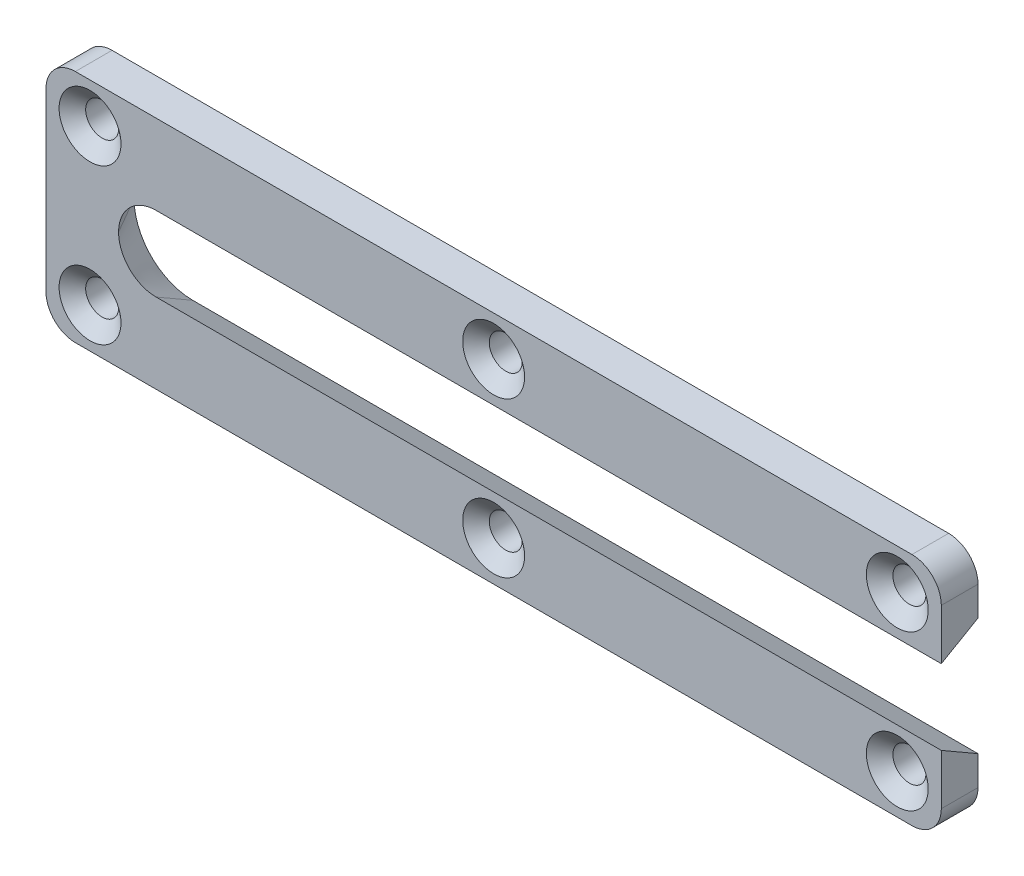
ISO-10303-21;
HEADER;
FILE_DESCRIPTION(('STEP AP214'),'2;1');
FILE_NAME('part.step','',(''),(''),'','','');
FILE_SCHEMA(('AUTOMOTIVE_DESIGN { 1 0 10303 214 1 1 1 1 }'));
ENDSEC;
DATA;
#1=APPLICATION_CONTEXT('core data for automotive mechanical design processes');
#2=APPLICATION_PROTOCOL_DEFINITION('international standard','automotive_design',2000,#1);
#3=PRODUCT_CONTEXT('',#1,'mechanical');
#4=PRODUCT('Part','Part','',(#3));
#5=PRODUCT_RELATED_PRODUCT_CATEGORY('part','',(#4));
#6=PRODUCT_DEFINITION_FORMATION('','',#4);
#7=PRODUCT_DEFINITION_CONTEXT('part definition',#1,'design');
#8=PRODUCT_DEFINITION('design','',#6,#7);
#9=PRODUCT_DEFINITION_SHAPE('','',#8);
#10=(LENGTH_UNIT() NAMED_UNIT(*) SI_UNIT(.MILLI.,.METRE.));
#11=(NAMED_UNIT(*) PLANE_ANGLE_UNIT() SI_UNIT($,.RADIAN.));
#12=(NAMED_UNIT(*) SI_UNIT($,.STERADIAN.) SOLID_ANGLE_UNIT());
#13=UNCERTAINTY_MEASURE_WITH_UNIT(LENGTH_MEASURE(1.E-05),#10,'distance_accuracy_value','');
#14=(GEOMETRIC_REPRESENTATION_CONTEXT(3) GLOBAL_UNCERTAINTY_ASSIGNED_CONTEXT((#13)) GLOBAL_UNIT_ASSIGNED_CONTEXT((#10,
#11,#12)) REPRESENTATION_CONTEXT('',''));
#15=CARTESIAN_POINT('',(0.,0.,0.));
#16=DIRECTION('',(0.,0.,1.));
#17=DIRECTION('',(1.,0.,0.));
#18=AXIS2_PLACEMENT_3D('',#15,#16,#17);
#19=CARTESIAN_POINT('',(0.,16.,5.));
#20=DIRECTION('',(-1.,0.,0.));
#21=DIRECTION('',(0.,-1.,0.));
#22=AXIS2_PLACEMENT_3D('',#19,#20,#21);
#23=PLANE('',#22);
#24=DIRECTION('',(0.,1.,0.));
#25=VECTOR('',#24,1.);
#26=CARTESIAN_POINT('',(0.,16.,0.));
#27=LINE('',#26,#25);
#28=CARTESIAN_POINT('',(0.,8.00000000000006,0.));
#29=VERTEX_POINT('',#28);
#30=CARTESIAN_POINT('',(0.,12.,0.));
#31=VERTEX_POINT('',#30);
#32=EDGE_CURVE('E144',#29,#31,#27,.T.);
#33=ORIENTED_EDGE('',*,*,#32,.T.);
#34=DIRECTION('',(0.,0.,-1.));
#35=VECTOR('',#34,1.);
#36=CARTESIAN_POINT('',(0.,12.,5.));
#37=LINE('',#36,#35);
#38=CARTESIAN_POINT('',(0.,12.,5.));
#39=VERTEX_POINT('',#38);
#40=EDGE_CURVE('E227',#31,#39,#37,.F.);
#41=ORIENTED_EDGE('',*,*,#40,.T.);
#42=DIRECTION('',(0.,1.,0.));
#43=VECTOR('',#42,1.);
#44=CARTESIAN_POINT('',(0.,16.,5.));
#45=LINE('',#44,#43);
#46=CARTESIAN_POINT('',(0.,5.11324865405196,5.));
#47=VERTEX_POINT('',#46);
#48=EDGE_CURVE('E147',#47,#39,#45,.T.);
#49=ORIENTED_EDGE('',*,*,#48,.F.);
#50=DIRECTION('',(0.,-0.499999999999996,0.866025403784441));
#51=VECTOR('',#50,1.);
#52=CARTESIAN_POINT('',(0.,3.,8.66025403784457));
#53=LINE('',#52,#51);
#54=EDGE_CURVE('E142',#47,#29,#53,.F.);
#55=ORIENTED_EDGE('',*,*,#54,.T.);
#56=EDGE_LOOP('',(#33,#41,#49,#55));
#57=FACE_BOUND('',#56,.T.);
#58=ADVANCED_FACE('F46',(#57),#23,.F.);
#59=CARTESIAN_POINT('',(-122.,16.,5.));
#60=DIRECTION('',(1.,0.,0.));
#61=DIRECTION('',(0.,0.,-1.));
#62=AXIS2_PLACEMENT_3D('',#59,#60,#61);
#63=PLANE('',#62);
#64=DIRECTION('',(0.,-1.,0.));
#65=VECTOR('',#64,1.);
#66=CARTESIAN_POINT('',(-122.,16.,0.));
#67=LINE('',#66,#65);
#68=CARTESIAN_POINT('',(-122.,12.,0.));
#69=VERTEX_POINT('',#68);
#70=CARTESIAN_POINT('',(-122.,-12.,0.));
#71=VERTEX_POINT('',#70);
#72=EDGE_CURVE('E200',#69,#71,#67,.T.);
#73=ORIENTED_EDGE('',*,*,#72,.T.);
#74=DIRECTION('',(0.,0.,-1.));
#75=VECTOR('',#74,1.);
#76=CARTESIAN_POINT('',(-122.,-12.,5.));
#77=LINE('',#76,#75);
#78=CARTESIAN_POINT('',(-122.,-12.,5.));
#79=VERTEX_POINT('',#78);
#80=EDGE_CURVE('E13',#71,#79,#77,.F.);
#81=ORIENTED_EDGE('',*,*,#80,.T.);
#82=DIRECTION('',(0.,-1.,0.));
#83=VECTOR('',#82,1.);
#84=CARTESIAN_POINT('',(-122.,16.,5.));
#85=LINE('',#84,#83);
#86=CARTESIAN_POINT('',(-122.,12.,5.));
#87=VERTEX_POINT('',#86);
#88=EDGE_CURVE('E232',#87,#79,#85,.T.);
#89=ORIENTED_EDGE('',*,*,#88,.F.);
#90=DIRECTION('',(0.,0.,-1.));
#91=VECTOR('',#90,1.);
#92=CARTESIAN_POINT('',(-122.,12.,5.));
#93=LINE('',#92,#91);
#94=EDGE_CURVE('E54',#87,#69,#93,.T.);
#95=ORIENTED_EDGE('',*,*,#94,.T.);
#96=EDGE_LOOP('',(#73,#81,#89,#95));
#97=FACE_BOUND('',#96,.T.);
#98=ADVANCED_FACE('F231',(#97),#63,.F.);
#99=CARTESIAN_POINT('',(-122.,-16.,5.));
#100=DIRECTION('',(0.,1.,0.));
#101=DIRECTION('',(-1.,0.,0.));
#102=AXIS2_PLACEMENT_3D('',#99,#100,#101);
#103=PLANE('',#102);
#104=DIRECTION('',(1.,0.,0.));
#105=VECTOR('',#104,1.);
#106=CARTESIAN_POINT('',(-122.,-16.,0.));
#107=LINE('',#106,#105);
#108=CARTESIAN_POINT('',(-118.,-16.,0.));
#109=VERTEX_POINT('',#108);
#110=CARTESIAN_POINT('',(-4.00000000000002,-16.,0.));
#111=VERTEX_POINT('',#110);
#112=EDGE_CURVE('E162',#109,#111,#107,.T.);
#113=ORIENTED_EDGE('',*,*,#112,.T.);
#114=DIRECTION('',(0.,0.,-1.));
#115=VECTOR('',#114,1.);
#116=CARTESIAN_POINT('',(-3.99999999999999,-16.,5.));
#117=LINE('',#116,#115);
#118=CARTESIAN_POINT('',(-4.00000000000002,-16.,5.));
#119=VERTEX_POINT('',#118);
#120=EDGE_CURVE('E213',#111,#119,#117,.F.);
#121=ORIENTED_EDGE('',*,*,#120,.T.);
#122=DIRECTION('',(1.,0.,0.));
#123=VECTOR('',#122,1.);
#124=CARTESIAN_POINT('',(-122.,-16.,5.));
#125=LINE('',#124,#123);
#126=CARTESIAN_POINT('',(-118.,-16.,5.));
#127=VERTEX_POINT('',#126);
#128=EDGE_CURVE('E244',#127,#119,#125,.T.);
#129=ORIENTED_EDGE('',*,*,#128,.F.);
#130=DIRECTION('',(0.,0.,-1.));
#131=VECTOR('',#130,1.);
#132=CARTESIAN_POINT('',(-118.,-16.,5.));
#133=LINE('',#132,#131);
#134=EDGE_CURVE('E210',#127,#109,#133,.T.);
#135=ORIENTED_EDGE('',*,*,#134,.T.);
#136=EDGE_LOOP('',(#113,#121,#129,#135));
#137=FACE_BOUND('',#136,.T.);
#138=ADVANCED_FACE('F276',(#137),#103,.F.);
#139=CARTESIAN_POINT('',(0.,-12.,5.));
#140=VERTEX_POINT('',#139);
#141=CARTESIAN_POINT('',(0.,-5.11324865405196,5.));
#142=VERTEX_POINT('',#141);
#143=EDGE_CURVE('E173',#140,#142,#45,.T.);
#144=ORIENTED_EDGE('',*,*,#143,.F.);
#145=DIRECTION('',(0.,0.,-1.));
#146=VECTOR('',#145,1.);
#147=CARTESIAN_POINT('',(0.,-12.,5.));
#148=LINE('',#147,#146);
#149=CARTESIAN_POINT('',(0.,-12.,0.));
#150=VERTEX_POINT('',#149);
#151=EDGE_CURVE('E151',#140,#150,#148,.T.);
#152=ORIENTED_EDGE('',*,*,#151,.T.);
#153=CARTESIAN_POINT('',(0.,-8.00000000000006,0.));
#154=VERTEX_POINT('',#153);
#155=EDGE_CURVE('E161',#150,#154,#27,.T.);
#156=ORIENTED_EDGE('',*,*,#155,.T.);
#157=DIRECTION('',(0.,-0.499999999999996,-0.866025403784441));
#158=VECTOR('',#157,1.);
#159=CARTESIAN_POINT('',(0.,-3.,8.66025403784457));
#160=LINE('',#159,#158);
#161=EDGE_CURVE('E182',#154,#142,#160,.F.);
#162=ORIENTED_EDGE('',*,*,#161,.T.);
#163=EDGE_LOOP('',(#144,#152,#156,#162));
#164=FACE_BOUND('',#163,.T.);
#165=ADVANCED_FACE('F272',(#164),#23,.F.);
#166=CARTESIAN_POINT('',(-122.,16.,5.));
#167=DIRECTION('',(0.,-1.,0.));
#168=DIRECTION('',(1.,0.,0.));
#169=AXIS2_PLACEMENT_3D('',#166,#167,#168);
#170=PLANE('',#169);
#171=DIRECTION('',(-1.,0.,0.));
#172=VECTOR('',#171,1.);
#173=CARTESIAN_POINT('',(-122.,16.,5.));
#174=LINE('',#173,#172);
#175=CARTESIAN_POINT('',(-4.00000000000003,16.,5.));
#176=VERTEX_POINT('',#175);
#177=CARTESIAN_POINT('',(-118.,16.,5.));
#178=VERTEX_POINT('',#177);
#179=EDGE_CURVE('E169',#176,#178,#174,.T.);
#180=ORIENTED_EDGE('',*,*,#179,.F.);
#181=DIRECTION('',(0.,0.,-1.));
#182=VECTOR('',#181,1.);
#183=CARTESIAN_POINT('',(-4.,16.,5.));
#184=LINE('',#183,#182);
#185=CARTESIAN_POINT('',(-4.00000000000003,16.,0.));
#186=VERTEX_POINT('',#185);
#187=EDGE_CURVE('E224',#176,#186,#184,.T.);
#188=ORIENTED_EDGE('',*,*,#187,.T.);
#189=DIRECTION('',(-1.,0.,0.));
#190=VECTOR('',#189,1.);
#191=CARTESIAN_POINT('',(-122.,16.,0.));
#192=LINE('',#191,#190);
#193=CARTESIAN_POINT('',(-118.,16.,0.));
#194=VERTEX_POINT('',#193);
#195=EDGE_CURVE('E176',#186,#194,#192,.T.);
#196=ORIENTED_EDGE('',*,*,#195,.T.);
#197=DIRECTION('',(0.,0.,-1.));
#198=VECTOR('',#197,1.);
#199=CARTESIAN_POINT('',(-118.,16.,5.));
#200=LINE('',#199,#198);
#201=EDGE_CURVE('E222',#194,#178,#200,.F.);
#202=ORIENTED_EDGE('',*,*,#201,.T.);
#203=EDGE_LOOP('',(#180,#188,#196,#202));
#204=FACE_BOUND('',#203,.T.);
#205=ADVANCED_FACE('F258',(#204),#170,.F.);
#206=CARTESIAN_POINT('',(0.,0.,5.));
#207=DIRECTION('',(0.,0.,1.));
#208=DIRECTION('',(1.,0.,0.));
#209=AXIS2_PLACEMENT_3D('',#206,#207,#208);
#210=PLANE('',#209);
#211=CARTESIAN_POINT('',(-5.99999999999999,-10.556624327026,5.));
#212=DIRECTION('',(0.,0.,1.));
#213=DIRECTION('',(1.,0.,0.));
#214=AXIS2_PLACEMENT_3D('',#211,#212,#213);
#215=CIRCLE('',#214,4.2164);
#216=CARTESIAN_POINT('',(-1.78359999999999,-10.556624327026,5.));
#217=VERTEX_POINT('',#216);
#218=EDGE_CURVE('E515',#217,#217,#215,.T.);
#219=ORIENTED_EDGE('',*,*,#218,.F.);
#220=EDGE_LOOP('',(#219));
#221=FACE_BOUND('',#220,.T.);
#222=CARTESIAN_POINT('',(-61.,-10.556624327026,5.));
#223=DIRECTION('',(0.,0.,1.));
#224=DIRECTION('',(1.,0.,0.));
#225=AXIS2_PLACEMENT_3D('',#222,#223,#224);
#226=CIRCLE('',#225,4.2164);
#227=CARTESIAN_POINT('',(-56.7836,-10.556624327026,5.));
#228=VERTEX_POINT('',#227);
#229=EDGE_CURVE('E506',#228,#228,#226,.T.);
#230=ORIENTED_EDGE('',*,*,#229,.F.);
#231=EDGE_LOOP('',(#230));
#232=FACE_BOUND('',#231,.T.);
#233=CARTESIAN_POINT('',(-5.99999999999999,10.556624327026,5.));
#234=DIRECTION('',(0.,0.,1.));
#235=DIRECTION('',(1.,0.,0.));
#236=AXIS2_PLACEMENT_3D('',#233,#234,#235);
#237=CIRCLE('',#236,4.2164);
#238=CARTESIAN_POINT('',(-1.78359999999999,10.556624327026,5.));
#239=VERTEX_POINT('',#238);
#240=EDGE_CURVE('E497',#239,#239,#237,.T.);
#241=ORIENTED_EDGE('',*,*,#240,.F.);
#242=EDGE_LOOP('',(#241));
#243=FACE_BOUND('',#242,.T.);
#244=CARTESIAN_POINT('',(-61.,10.556624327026,5.));
#245=DIRECTION('',(0.,0.,1.));
#246=DIRECTION('',(1.,0.,0.));
#247=AXIS2_PLACEMENT_3D('',#244,#245,#246);
#248=CIRCLE('',#247,4.2164);
#249=CARTESIAN_POINT('',(-56.7836,10.556624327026,5.));
#250=VERTEX_POINT('',#249);
#251=EDGE_CURVE('E488',#250,#250,#248,.T.);
#252=ORIENTED_EDGE('',*,*,#251,.F.);
#253=EDGE_LOOP('',(#252));
#254=FACE_BOUND('',#253,.T.);
#255=CARTESIAN_POINT('',(-116.,-10.556624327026,5.));
#256=DIRECTION('',(0.,0.,1.));
#257=DIRECTION('',(1.,0.,0.));
#258=AXIS2_PLACEMENT_3D('',#255,#256,#257);
#259=CIRCLE('',#258,4.21639999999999);
#260=CARTESIAN_POINT('',(-111.7836,-10.556624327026,5.));
#261=VERTEX_POINT('',#260);
#262=EDGE_CURVE('E479',#261,#261,#259,.T.);
#263=ORIENTED_EDGE('',*,*,#262,.F.);
#264=EDGE_LOOP('',(#263));
#265=FACE_BOUND('',#264,.T.);
#266=CARTESIAN_POINT('',(-116.,10.556624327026,5.));
#267=DIRECTION('',(0.,0.,1.));
#268=DIRECTION('',(1.,0.,0.));
#269=AXIS2_PLACEMENT_3D('',#266,#267,#268);
#270=CIRCLE('',#269,4.21639999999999);
#271=CARTESIAN_POINT('',(-111.7836,10.556624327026,5.));
#272=VERTEX_POINT('',#271);
#273=EDGE_CURVE('E469',#272,#272,#270,.T.);
#274=ORIENTED_EDGE('',*,*,#273,.F.);
#275=EDGE_LOOP('',(#274));
#276=FACE_BOUND('',#275,.T.);
#277=ORIENTED_EDGE('',*,*,#128,.T.);
#278=CARTESIAN_POINT('',(-4.,-12.,5.));
#279=DIRECTION('',(0.,0.,1.));
#280=DIRECTION('',(1.,0.,0.));
#281=AXIS2_PLACEMENT_3D('',#278,#279,#280);
#282=CIRCLE('',#281,4.);
#283=EDGE_CURVE('E220',#119,#140,#282,.T.);
#284=ORIENTED_EDGE('',*,*,#283,.T.);
#285=ORIENTED_EDGE('',*,*,#143,.T.);
#286=DIRECTION('',(1.,0.,0.));
#287=VECTOR('',#286,1.);
#288=CARTESIAN_POINT('',(0.,-5.11324865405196,5.));
#289=LINE('',#288,#287);
#290=CARTESIAN_POINT('',(-107.,-5.11324865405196,5.));
#291=VERTEX_POINT('',#290);
#292=EDGE_CURVE('E152',#142,#291,#289,.F.);
#293=ORIENTED_EDGE('',*,*,#292,.T.);
#294=CARTESIAN_POINT('',(-107.,0.,5.));
#295=DIRECTION('',(0.,0.,1.));
#296=DIRECTION('',(1.,0.,0.));
#297=AXIS2_PLACEMENT_3D('',#294,#295,#296);
#298=CIRCLE('',#297,5.11324865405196);
#299=CARTESIAN_POINT('',(-112.113248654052,0.,5.));
#300=VERTEX_POINT('',#299);
#301=EDGE_CURVE('E189',#291,#300,#298,.F.);
#302=ORIENTED_EDGE('',*,*,#301,.T.);
#303=CARTESIAN_POINT('',(-107.,0.,5.));
#304=DIRECTION('',(0.,0.,1.));
#305=DIRECTION('',(1.,0.,0.));
#306=AXIS2_PLACEMENT_3D('',#303,#304,#305);
#307=CIRCLE('',#306,5.11324865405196);
#308=CARTESIAN_POINT('',(-107.,5.11324865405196,5.));
#309=VERTEX_POINT('',#308);
#310=EDGE_CURVE('E187',#300,#309,#307,.F.);
#311=ORIENTED_EDGE('',*,*,#310,.T.);
#312=DIRECTION('',(-1.,0.,0.));
#313=VECTOR('',#312,1.);
#314=CARTESIAN_POINT('',(0.,5.11324865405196,5.));
#315=LINE('',#314,#313);
#316=EDGE_CURVE('E185',#309,#47,#315,.F.);
#317=ORIENTED_EDGE('',*,*,#316,.T.);
#318=ORIENTED_EDGE('',*,*,#48,.T.);
#319=CARTESIAN_POINT('',(-4.,12.,5.));
#320=DIRECTION('',(0.,0.,1.));
#321=DIRECTION('',(1.,0.,0.));
#322=AXIS2_PLACEMENT_3D('',#319,#320,#321);
#323=CIRCLE('',#322,4.);
#324=EDGE_CURVE('E218',#39,#176,#323,.T.);
#325=ORIENTED_EDGE('',*,*,#324,.T.);
#326=ORIENTED_EDGE('',*,*,#179,.T.);
#327=CARTESIAN_POINT('',(-118.,12.,5.));
#328=DIRECTION('',(0.,0.,1.));
#329=DIRECTION('',(1.,0.,0.));
#330=AXIS2_PLACEMENT_3D('',#327,#328,#329);
#331=CIRCLE('',#330,4.);
#332=EDGE_CURVE('E66',#178,#87,#331,.T.);
#333=ORIENTED_EDGE('',*,*,#332,.T.);
#334=ORIENTED_EDGE('',*,*,#88,.T.);
#335=CARTESIAN_POINT('',(-118.,-12.,5.));
#336=DIRECTION('',(0.,0.,1.));
#337=DIRECTION('',(1.,0.,0.));
#338=AXIS2_PLACEMENT_3D('',#335,#336,#337);
#339=CIRCLE('',#338,4.);
#340=EDGE_CURVE('E216',#79,#127,#339,.T.);
#341=ORIENTED_EDGE('',*,*,#340,.T.);
#342=EDGE_LOOP('',(#277,#284,#285,#293,#302,#311,#317,#318,#325,#326,#333,#334,#341));
#343=FACE_BOUND('',#342,.T.);
#344=ADVANCED_FACE('F253',(#221,#232,#243,#254,#265,#276,#343),#210,.T.);
#345=CARTESIAN_POINT('',(0.,0.,0.));
#346=DIRECTION('',(0.,0.,1.));
#347=DIRECTION('',(1.,0.,0.));
#348=AXIS2_PLACEMENT_3D('',#345,#346,#347);
#349=PLANE('',#348);
#350=CARTESIAN_POINT('',(-5.99999999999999,-10.556624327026,0.));
#351=DIRECTION('',(0.,0.,1.));
#352=DIRECTION('',(1.,0.,0.));
#353=AXIS2_PLACEMENT_3D('',#350,#351,#352);
#354=CIRCLE('',#353,2.2479);
#355=CARTESIAN_POINT('',(-3.75209999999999,-10.556624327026,0.));
#356=VERTEX_POINT('',#355);
#357=EDGE_CURVE('E509',#356,#356,#354,.T.);
#358=ORIENTED_EDGE('',*,*,#357,.T.);
#359=EDGE_LOOP('',(#358));
#360=FACE_BOUND('',#359,.T.);
#361=CARTESIAN_POINT('',(-61.,-10.556624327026,0.));
#362=DIRECTION('',(0.,0.,1.));
#363=DIRECTION('',(1.,0.,0.));
#364=AXIS2_PLACEMENT_3D('',#361,#362,#363);
#365=CIRCLE('',#364,2.2479);
#366=CARTESIAN_POINT('',(-58.7521,-10.556624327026,0.));
#367=VERTEX_POINT('',#366);
#368=EDGE_CURVE('E500',#367,#367,#365,.T.);
#369=ORIENTED_EDGE('',*,*,#368,.T.);
#370=EDGE_LOOP('',(#369));
#371=FACE_BOUND('',#370,.T.);
#372=CARTESIAN_POINT('',(-5.99999999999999,10.556624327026,0.));
#373=DIRECTION('',(0.,0.,1.));
#374=DIRECTION('',(1.,0.,0.));
#375=AXIS2_PLACEMENT_3D('',#372,#373,#374);
#376=CIRCLE('',#375,2.2479);
#377=CARTESIAN_POINT('',(-3.75209999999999,10.556624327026,0.));
#378=VERTEX_POINT('',#377);
#379=EDGE_CURVE('E491',#378,#378,#376,.T.);
#380=ORIENTED_EDGE('',*,*,#379,.T.);
#381=EDGE_LOOP('',(#380));
#382=FACE_BOUND('',#381,.T.);
#383=CARTESIAN_POINT('',(-61.,10.556624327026,0.));
#384=DIRECTION('',(0.,0.,1.));
#385=DIRECTION('',(1.,0.,0.));
#386=AXIS2_PLACEMENT_3D('',#383,#384,#385);
#387=CIRCLE('',#386,2.2479);
#388=CARTESIAN_POINT('',(-58.7521,10.556624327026,0.));
#389=VERTEX_POINT('',#388);
#390=EDGE_CURVE('E482',#389,#389,#387,.T.);
#391=ORIENTED_EDGE('',*,*,#390,.T.);
#392=EDGE_LOOP('',(#391));
#393=FACE_BOUND('',#392,.T.);
#394=CARTESIAN_POINT('',(-116.,-10.556624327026,0.));
#395=DIRECTION('',(0.,0.,1.));
#396=DIRECTION('',(1.,0.,0.));
#397=AXIS2_PLACEMENT_3D('',#394,#395,#396);
#398=CIRCLE('',#397,2.2479);
#399=CARTESIAN_POINT('',(-113.7521,-10.556624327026,0.));
#400=VERTEX_POINT('',#399);
#401=EDGE_CURVE('E471',#400,#400,#398,.T.);
#402=ORIENTED_EDGE('',*,*,#401,.T.);
#403=EDGE_LOOP('',(#402));
#404=FACE_BOUND('',#403,.T.);
#405=CARTESIAN_POINT('',(-116.,10.556624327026,0.));
#406=DIRECTION('',(0.,0.,1.));
#407=DIRECTION('',(1.,0.,0.));
#408=AXIS2_PLACEMENT_3D('',#405,#406,#407);
#409=CIRCLE('',#408,2.2479);
#410=CARTESIAN_POINT('',(-113.7521,10.556624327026,0.));
#411=VERTEX_POINT('',#410);
#412=EDGE_CURVE('E196',#411,#411,#409,.T.);
#413=ORIENTED_EDGE('',*,*,#412,.T.);
#414=EDGE_LOOP('',(#413));
#415=FACE_BOUND('',#414,.T.);
#416=ORIENTED_EDGE('',*,*,#155,.F.);
#417=CARTESIAN_POINT('',(-4.,-12.,0.));
#418=DIRECTION('',(0.,0.,1.));
#419=DIRECTION('',(1.,0.,0.));
#420=AXIS2_PLACEMENT_3D('',#417,#418,#419);
#421=CIRCLE('',#420,4.);
#422=EDGE_CURVE('E208',#150,#111,#421,.F.);
#423=ORIENTED_EDGE('',*,*,#422,.T.);
#424=ORIENTED_EDGE('',*,*,#112,.F.);
#425=CARTESIAN_POINT('',(-118.,-12.,0.));
#426=DIRECTION('',(0.,0.,1.));
#427=DIRECTION('',(1.,0.,0.));
#428=AXIS2_PLACEMENT_3D('',#425,#426,#427);
#429=CIRCLE('',#428,4.);
#430=EDGE_CURVE('E205',#109,#71,#429,.F.);
#431=ORIENTED_EDGE('',*,*,#430,.T.);
#432=ORIENTED_EDGE('',*,*,#72,.F.);
#433=CARTESIAN_POINT('',(-118.,12.,0.));
#434=DIRECTION('',(0.,0.,1.));
#435=DIRECTION('',(1.,0.,0.));
#436=AXIS2_PLACEMENT_3D('',#433,#434,#435);
#437=CIRCLE('',#436,4.);
#438=EDGE_CURVE('E203',#69,#194,#437,.F.);
#439=ORIENTED_EDGE('',*,*,#438,.T.);
#440=ORIENTED_EDGE('',*,*,#195,.F.);
#441=CARTESIAN_POINT('',(-4.,12.,0.));
#442=DIRECTION('',(0.,0.,1.));
#443=DIRECTION('',(1.,0.,0.));
#444=AXIS2_PLACEMENT_3D('',#441,#442,#443);
#445=CIRCLE('',#444,4.);
#446=EDGE_CURVE('E160',#186,#31,#445,.F.);
#447=ORIENTED_EDGE('',*,*,#446,.T.);
#448=ORIENTED_EDGE('',*,*,#32,.F.);
#449=DIRECTION('',(-1.,0.,0.));
#450=VECTOR('',#449,1.);
#451=CARTESIAN_POINT('',(0.,8.00000000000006,0.));
#452=LINE('',#451,#450);
#453=CARTESIAN_POINT('',(-107.,8.00000000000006,0.));
#454=VERTEX_POINT('',#453);
#455=EDGE_CURVE('E157',#29,#454,#452,.T.);
#456=ORIENTED_EDGE('',*,*,#455,.T.);
#457=CARTESIAN_POINT('',(-107.,0.,0.));
#458=DIRECTION('',(0.,0.,1.));
#459=DIRECTION('',(1.,0.,0.));
#460=AXIS2_PLACEMENT_3D('',#457,#458,#459);
#461=CIRCLE('',#460,8.00000000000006);
#462=CARTESIAN_POINT('',(-115.,0.,0.));
#463=VERTEX_POINT('',#462);
#464=EDGE_CURVE('E168',#454,#463,#461,.T.);
#465=ORIENTED_EDGE('',*,*,#464,.T.);
#466=CARTESIAN_POINT('',(-107.,0.,0.));
#467=DIRECTION('',(0.,0.,1.));
#468=DIRECTION('',(1.,0.,0.));
#469=AXIS2_PLACEMENT_3D('',#466,#467,#468);
#470=CIRCLE('',#469,8.00000000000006);
#471=CARTESIAN_POINT('',(-107.,-8.00000000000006,0.));
#472=VERTEX_POINT('',#471);
#473=EDGE_CURVE('E171',#463,#472,#470,.T.);
#474=ORIENTED_EDGE('',*,*,#473,.T.);
#475=DIRECTION('',(1.,0.,0.));
#476=VECTOR('',#475,1.);
#477=CARTESIAN_POINT('',(0.,-8.00000000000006,0.));
#478=LINE('',#477,#476);
#479=EDGE_CURVE('E179',#472,#154,#478,.T.);
#480=ORIENTED_EDGE('',*,*,#479,.T.);
#481=EDGE_LOOP('',(#416,#423,#424,#431,#432,#439,#440,#447,#448,#456,#465,#474,#480));
#482=FACE_BOUND('',#481,.T.);
#483=ADVANCED_FACE('F156',(#360,#371,#382,#393,#404,#415,#482),#349,.F.);
#484=CARTESIAN_POINT('',(0.,3.,8.66025403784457));
#485=DIRECTION('',(0.,0.866025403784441,0.499999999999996));
#486=DIRECTION('',(1.,0.,0.));
#487=AXIS2_PLACEMENT_3D('',#484,#485,#486);
#488=PLANE('',#487);
#489=ORIENTED_EDGE('',*,*,#54,.F.);
#490=ORIENTED_EDGE('',*,*,#316,.F.);
#491=DIRECTION('',(0.,-0.499999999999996,0.866025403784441));
#492=VECTOR('',#491,1.);
#493=CARTESIAN_POINT('',(-107.,8.00000000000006,0.));
#494=LINE('',#493,#492);
#495=EDGE_CURVE('E166',#454,#309,#494,.T.);
#496=ORIENTED_EDGE('',*,*,#495,.F.);
#497=ORIENTED_EDGE('',*,*,#455,.F.);
#498=EDGE_LOOP('',(#489,#490,#496,#497));
#499=FACE_BOUND('',#498,.T.);
#500=ADVANCED_FACE('F164',(#499),#488,.F.);
#501=CARTESIAN_POINT('',(-107.,0.,0.));
#502=DIRECTION('',(0.,0.,-1.));
#503=DIRECTION('',(-1.,0.,0.));
#504=AXIS2_PLACEMENT_3D('',#501,#502,#503);
#505=CONICAL_SURFACE('',#504,8.00000000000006,0.523598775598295);
#506=ORIENTED_EDGE('',*,*,#495,.T.);
#507=ORIENTED_EDGE('',*,*,#310,.F.);
#508=DIRECTION('',(0.499999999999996,0.,0.866025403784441));
#509=VECTOR('',#508,1.);
#510=CARTESIAN_POINT('',(-115.,0.,0.));
#511=LINE('',#510,#509);
#512=EDGE_CURVE('E195',#463,#300,#511,.T.);
#513=ORIENTED_EDGE('',*,*,#512,.F.);
#514=ORIENTED_EDGE('',*,*,#464,.F.);
#515=EDGE_LOOP('',(#506,#507,#513,#514));
#516=FACE_BOUND('',#515,.T.);
#517=ADVANCED_FACE('F305',(#516),#505,.F.);
#518=CARTESIAN_POINT('',(-107.,0.,0.));
#519=DIRECTION('',(0.,0.,-1.));
#520=DIRECTION('',(-1.,0.,0.));
#521=AXIS2_PLACEMENT_3D('',#518,#519,#520);
#522=CONICAL_SURFACE('',#521,8.00000000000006,0.523598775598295);
#523=ORIENTED_EDGE('',*,*,#512,.T.);
#524=ORIENTED_EDGE('',*,*,#301,.F.);
#525=DIRECTION('',(0.,0.499999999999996,0.866025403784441));
#526=VECTOR('',#525,1.);
#527=CARTESIAN_POINT('',(-107.,-8.00000000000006,0.));
#528=LINE('',#527,#526);
#529=EDGE_CURVE('E192',#472,#291,#528,.T.);
#530=ORIENTED_EDGE('',*,*,#529,.F.);
#531=ORIENTED_EDGE('',*,*,#473,.F.);
#532=EDGE_LOOP('',(#523,#524,#530,#531));
#533=FACE_BOUND('',#532,.T.);
#534=ADVANCED_FACE('F301',(#533),#522,.F.);
#535=CARTESIAN_POINT('',(0.,-3.,8.66025403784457));
#536=DIRECTION('',(0.,-0.866025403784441,0.499999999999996));
#537=DIRECTION('',(-1.,0.,0.));
#538=AXIS2_PLACEMENT_3D('',#535,#536,#537);
#539=PLANE('',#538);
#540=ORIENTED_EDGE('',*,*,#161,.F.);
#541=ORIENTED_EDGE('',*,*,#479,.F.);
#542=ORIENTED_EDGE('',*,*,#529,.T.);
#543=ORIENTED_EDGE('',*,*,#292,.F.);
#544=EDGE_LOOP('',(#540,#541,#542,#543));
#545=FACE_BOUND('',#544,.T.);
#546=ADVANCED_FACE('F298',(#545),#539,.F.);
#547=CARTESIAN_POINT('',(-116.,10.556624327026,5.));
#548=DIRECTION('',(0.,0.,1.));
#549=DIRECTION('',(1.,0.,0.));
#550=AXIS2_PLACEMENT_3D('',#547,#548,#549);
#551=CYLINDRICAL_SURFACE('',#550,2.2479);
#552=ORIENTED_EDGE('',*,*,#412,.F.);
#553=EDGE_LOOP('',(#552));
#554=FACE_BOUND('',#553,.T.);
#555=CARTESIAN_POINT('',(-116.,10.556624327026,3.34823237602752));
#556=DIRECTION('',(0.,0.,1.));
#557=DIRECTION('',(1.,0.,0.));
#558=AXIS2_PLACEMENT_3D('',#555,#556,#557);
#559=CIRCLE('',#558,2.2479);
#560=CARTESIAN_POINT('',(-113.7521,10.556624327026,3.34823237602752));
#561=VERTEX_POINT('',#560);
#562=EDGE_CURVE('E468',#561,#561,#559,.T.);
#563=ORIENTED_EDGE('',*,*,#562,.T.);
#564=EDGE_LOOP('',(#563));
#565=FACE_BOUND('',#564,.T.);
#566=ADVANCED_FACE('F456',(#554,#565),#551,.F.);
#567=CARTESIAN_POINT('',(-116.,10.556624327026,5.));
#568=DIRECTION('',(0.,0.,1.));
#569=DIRECTION('',(1.,0.,0.));
#570=AXIS2_PLACEMENT_3D('',#567,#568,#569);
#571=CONICAL_SURFACE('',#570,4.21639999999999,0.872664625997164);
#572=ORIENTED_EDGE('',*,*,#562,.F.);
#573=EDGE_LOOP('',(#572));
#574=FACE_BOUND('',#573,.T.);
#575=ORIENTED_EDGE('',*,*,#273,.T.);
#576=EDGE_LOOP('',(#575));
#577=FACE_BOUND('',#576,.T.);
#578=ADVANCED_FACE('F318',(#574,#577),#571,.F.);
#579=CARTESIAN_POINT('',(-4.,-12.,5.));
#580=DIRECTION('',(0.,0.,-1.));
#581=DIRECTION('',(-1.,0.,0.));
#582=AXIS2_PLACEMENT_3D('',#579,#580,#581);
#583=CYLINDRICAL_SURFACE('',#582,4.);
#584=ORIENTED_EDGE('',*,*,#283,.F.);
#585=ORIENTED_EDGE('',*,*,#120,.F.);
#586=ORIENTED_EDGE('',*,*,#422,.F.);
#587=ORIENTED_EDGE('',*,*,#151,.F.);
#588=EDGE_LOOP('',(#584,#585,#586,#587));
#589=FACE_BOUND('',#588,.T.);
#590=ADVANCED_FACE('F290',(#589),#583,.T.);
#591=CARTESIAN_POINT('',(-4.,12.,5.));
#592=DIRECTION('',(0.,0.,-1.));
#593=DIRECTION('',(-1.,0.,0.));
#594=AXIS2_PLACEMENT_3D('',#591,#592,#593);
#595=CYLINDRICAL_SURFACE('',#594,4.);
#596=ORIENTED_EDGE('',*,*,#324,.F.);
#597=ORIENTED_EDGE('',*,*,#40,.F.);
#598=ORIENTED_EDGE('',*,*,#446,.F.);
#599=ORIENTED_EDGE('',*,*,#187,.F.);
#600=EDGE_LOOP('',(#596,#597,#598,#599));
#601=FACE_BOUND('',#600,.T.);
#602=ADVANCED_FACE('F257',(#601),#595,.T.);
#603=CARTESIAN_POINT('',(-118.,-12.,5.));
#604=DIRECTION('',(0.,0.,-1.));
#605=DIRECTION('',(-1.,0.,0.));
#606=AXIS2_PLACEMENT_3D('',#603,#604,#605);
#607=CYLINDRICAL_SURFACE('',#606,4.);
#608=ORIENTED_EDGE('',*,*,#340,.F.);
#609=ORIENTED_EDGE('',*,*,#80,.F.);
#610=ORIENTED_EDGE('',*,*,#430,.F.);
#611=ORIENTED_EDGE('',*,*,#134,.F.);
#612=EDGE_LOOP('',(#608,#609,#610,#611));
#613=FACE_BOUND('',#612,.T.);
#614=ADVANCED_FACE('F261',(#613),#607,.T.);
#615=CARTESIAN_POINT('',(-118.,12.,5.));
#616=DIRECTION('',(0.,0.,-1.));
#617=DIRECTION('',(-1.,0.,0.));
#618=AXIS2_PLACEMENT_3D('',#615,#616,#617);
#619=CYLINDRICAL_SURFACE('',#618,4.);
#620=ORIENTED_EDGE('',*,*,#332,.F.);
#621=ORIENTED_EDGE('',*,*,#201,.F.);
#622=ORIENTED_EDGE('',*,*,#438,.F.);
#623=ORIENTED_EDGE('',*,*,#94,.F.);
#624=EDGE_LOOP('',(#620,#621,#622,#623));
#625=FACE_BOUND('',#624,.T.);
#626=ADVANCED_FACE('F48',(#625),#619,.T.);
#627=CARTESIAN_POINT('',(-116.,-10.556624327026,5.));
#628=DIRECTION('',(0.,0.,1.));
#629=DIRECTION('',(1.,0.,0.));
#630=AXIS2_PLACEMENT_3D('',#627,#628,#629);
#631=CYLINDRICAL_SURFACE('',#630,2.2479);
#632=ORIENTED_EDGE('',*,*,#401,.F.);
#633=EDGE_LOOP('',(#632));
#634=FACE_BOUND('',#633,.T.);
#635=CARTESIAN_POINT('',(-116.,-10.556624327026,3.34823237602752));
#636=DIRECTION('',(0.,0.,1.));
#637=DIRECTION('',(1.,0.,0.));
#638=AXIS2_PLACEMENT_3D('',#635,#636,#637);
#639=CIRCLE('',#638,2.2479);
#640=CARTESIAN_POINT('',(-113.7521,-10.556624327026,3.34823237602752));
#641=VERTEX_POINT('',#640);
#642=EDGE_CURVE('E476',#641,#641,#639,.T.);
#643=ORIENTED_EDGE('',*,*,#642,.T.);
#644=EDGE_LOOP('',(#643));
#645=FACE_BOUND('',#644,.T.);
#646=ADVANCED_FACE('F260',(#634,#645),#631,.F.);
#647=CARTESIAN_POINT('',(-116.,-10.556624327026,5.));
#648=DIRECTION('',(0.,0.,1.));
#649=DIRECTION('',(1.,0.,0.));
#650=AXIS2_PLACEMENT_3D('',#647,#648,#649);
#651=CONICAL_SURFACE('',#650,4.21639999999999,0.872664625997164);
#652=ORIENTED_EDGE('',*,*,#642,.F.);
#653=EDGE_LOOP('',(#652));
#654=FACE_BOUND('',#653,.T.);
#655=ORIENTED_EDGE('',*,*,#262,.T.);
#656=EDGE_LOOP('',(#655));
#657=FACE_BOUND('',#656,.T.);
#658=ADVANCED_FACE('F266',(#654,#657),#651,.F.);
#659=CARTESIAN_POINT('',(-61.,10.556624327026,5.));
#660=DIRECTION('',(0.,0.,1.));
#661=DIRECTION('',(1.,0.,0.));
#662=AXIS2_PLACEMENT_3D('',#659,#660,#661);
#663=CYLINDRICAL_SURFACE('',#662,2.2479);
#664=ORIENTED_EDGE('',*,*,#390,.F.);
#665=EDGE_LOOP('',(#664));
#666=FACE_BOUND('',#665,.T.);
#667=CARTESIAN_POINT('',(-61.,10.556624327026,3.34823237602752));
#668=DIRECTION('',(0.,0.,1.));
#669=DIRECTION('',(1.,0.,0.));
#670=AXIS2_PLACEMENT_3D('',#667,#668,#669);
#671=CIRCLE('',#670,2.2479);
#672=CARTESIAN_POINT('',(-58.7521,10.556624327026,3.34823237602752));
#673=VERTEX_POINT('',#672);
#674=EDGE_CURVE('E485',#673,#673,#671,.T.);
#675=ORIENTED_EDGE('',*,*,#674,.T.);
#676=EDGE_LOOP('',(#675));
#677=FACE_BOUND('',#676,.T.);
#678=ADVANCED_FACE('F348',(#666,#677),#663,.F.);
#679=CARTESIAN_POINT('',(-61.,10.556624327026,5.));
#680=DIRECTION('',(0.,0.,1.));
#681=DIRECTION('',(1.,0.,0.));
#682=AXIS2_PLACEMENT_3D('',#679,#680,#681);
#683=CONICAL_SURFACE('',#682,4.2164,0.872664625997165);
#684=ORIENTED_EDGE('',*,*,#674,.F.);
#685=EDGE_LOOP('',(#684));
#686=FACE_BOUND('',#685,.T.);
#687=ORIENTED_EDGE('',*,*,#251,.T.);
#688=EDGE_LOOP('',(#687));
#689=FACE_BOUND('',#688,.T.);
#690=ADVANCED_FACE('F378',(#686,#689),#683,.F.);
#691=CARTESIAN_POINT('',(-5.99999999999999,10.556624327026,5.));
#692=DIRECTION('',(0.,0.,1.));
#693=DIRECTION('',(1.,0.,0.));
#694=AXIS2_PLACEMENT_3D('',#691,#692,#693);
#695=CYLINDRICAL_SURFACE('',#694,2.2479);
#696=ORIENTED_EDGE('',*,*,#379,.F.);
#697=EDGE_LOOP('',(#696));
#698=FACE_BOUND('',#697,.T.);
#699=CARTESIAN_POINT('',(-5.99999999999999,10.556624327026,3.34823237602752));
#700=DIRECTION('',(0.,0.,1.));
#701=DIRECTION('',(1.,0.,0.));
#702=AXIS2_PLACEMENT_3D('',#699,#700,#701);
#703=CIRCLE('',#702,2.2479);
#704=CARTESIAN_POINT('',(-3.75209999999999,10.556624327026,3.34823237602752));
#705=VERTEX_POINT('',#704);
#706=EDGE_CURVE('E494',#705,#705,#703,.T.);
#707=ORIENTED_EDGE('',*,*,#706,.T.);
#708=EDGE_LOOP('',(#707));
#709=FACE_BOUND('',#708,.T.);
#710=ADVANCED_FACE('F388',(#698,#709),#695,.F.);
#711=CARTESIAN_POINT('',(-5.99999999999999,10.556624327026,5.));
#712=DIRECTION('',(0.,0.,1.));
#713=DIRECTION('',(1.,0.,0.));
#714=AXIS2_PLACEMENT_3D('',#711,#712,#713);
#715=CONICAL_SURFACE('',#714,4.2164,0.872664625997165);
#716=ORIENTED_EDGE('',*,*,#706,.F.);
#717=EDGE_LOOP('',(#716));
#718=FACE_BOUND('',#717,.T.);
#719=ORIENTED_EDGE('',*,*,#240,.T.);
#720=EDGE_LOOP('',(#719));
#721=FACE_BOUND('',#720,.T.);
#722=ADVANCED_FACE('F398',(#718,#721),#715,.F.);
#723=CARTESIAN_POINT('',(-61.,-10.556624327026,5.));
#724=DIRECTION('',(0.,0.,1.));
#725=DIRECTION('',(1.,0.,0.));
#726=AXIS2_PLACEMENT_3D('',#723,#724,#725);
#727=CYLINDRICAL_SURFACE('',#726,2.2479);
#728=ORIENTED_EDGE('',*,*,#368,.F.);
#729=EDGE_LOOP('',(#728));
#730=FACE_BOUND('',#729,.T.);
#731=CARTESIAN_POINT('',(-61.,-10.556624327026,3.34823237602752));
#732=DIRECTION('',(0.,0.,1.));
#733=DIRECTION('',(1.,0.,0.));
#734=AXIS2_PLACEMENT_3D('',#731,#732,#733);
#735=CIRCLE('',#734,2.2479);
#736=CARTESIAN_POINT('',(-58.7521,-10.556624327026,3.34823237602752));
#737=VERTEX_POINT('',#736);
#738=EDGE_CURVE('E503',#737,#737,#735,.T.);
#739=ORIENTED_EDGE('',*,*,#738,.T.);
#740=EDGE_LOOP('',(#739));
#741=FACE_BOUND('',#740,.T.);
#742=ADVANCED_FACE('F408',(#730,#741),#727,.F.);
#743=CARTESIAN_POINT('',(-61.,-10.556624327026,5.));
#744=DIRECTION('',(0.,0.,1.));
#745=DIRECTION('',(1.,0.,0.));
#746=AXIS2_PLACEMENT_3D('',#743,#744,#745);
#747=CONICAL_SURFACE('',#746,4.2164,0.872664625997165);
#748=ORIENTED_EDGE('',*,*,#738,.F.);
#749=EDGE_LOOP('',(#748));
#750=FACE_BOUND('',#749,.T.);
#751=ORIENTED_EDGE('',*,*,#229,.T.);
#752=EDGE_LOOP('',(#751));
#753=FACE_BOUND('',#752,.T.);
#754=ADVANCED_FACE('F418',(#750,#753),#747,.F.);
#755=CARTESIAN_POINT('',(-5.99999999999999,-10.556624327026,5.));
#756=DIRECTION('',(0.,0.,1.));
#757=DIRECTION('',(1.,0.,0.));
#758=AXIS2_PLACEMENT_3D('',#755,#756,#757);
#759=CYLINDRICAL_SURFACE('',#758,2.2479);
#760=ORIENTED_EDGE('',*,*,#357,.F.);
#761=EDGE_LOOP('',(#760));
#762=FACE_BOUND('',#761,.T.);
#763=CARTESIAN_POINT('',(-5.99999999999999,-10.556624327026,3.34823237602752));
#764=DIRECTION('',(0.,0.,1.));
#765=DIRECTION('',(1.,0.,0.));
#766=AXIS2_PLACEMENT_3D('',#763,#764,#765);
#767=CIRCLE('',#766,2.2479);
#768=CARTESIAN_POINT('',(-3.75209999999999,-10.556624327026,3.34823237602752));
#769=VERTEX_POINT('',#768);
#770=EDGE_CURVE('E512',#769,#769,#767,.T.);
#771=ORIENTED_EDGE('',*,*,#770,.T.);
#772=EDGE_LOOP('',(#771));
#773=FACE_BOUND('',#772,.T.);
#774=ADVANCED_FACE('F428',(#762,#773),#759,.F.);
#775=CARTESIAN_POINT('',(-5.99999999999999,-10.556624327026,5.));
#776=DIRECTION('',(0.,0.,1.));
#777=DIRECTION('',(1.,0.,0.));
#778=AXIS2_PLACEMENT_3D('',#775,#776,#777);
#779=CONICAL_SURFACE('',#778,4.2164,0.872664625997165);
#780=ORIENTED_EDGE('',*,*,#770,.F.);
#781=EDGE_LOOP('',(#780));
#782=FACE_BOUND('',#781,.T.);
#783=ORIENTED_EDGE('',*,*,#218,.T.);
#784=EDGE_LOOP('',(#783));
#785=FACE_BOUND('',#784,.T.);
#786=ADVANCED_FACE('F438',(#782,#785),#779,.F.);
#787=CLOSED_SHELL('',(#58,#98,#138,#165,#205,#344,#483,#500,#517,#534,#546,#566,#578,#590,#602,
#614,#626,#646,#658,#678,#690,#710,#722,#742,#754,#774,#786));
#788=MANIFOLD_SOLID_BREP('B2',#787);
#789=ADVANCED_BREP_SHAPE_REPRESENTATION('',(#18,#788),#14);
#790=SHAPE_DEFINITION_REPRESENTATION(#9,#789);
ENDSEC;
END-ISO-10303-21;
